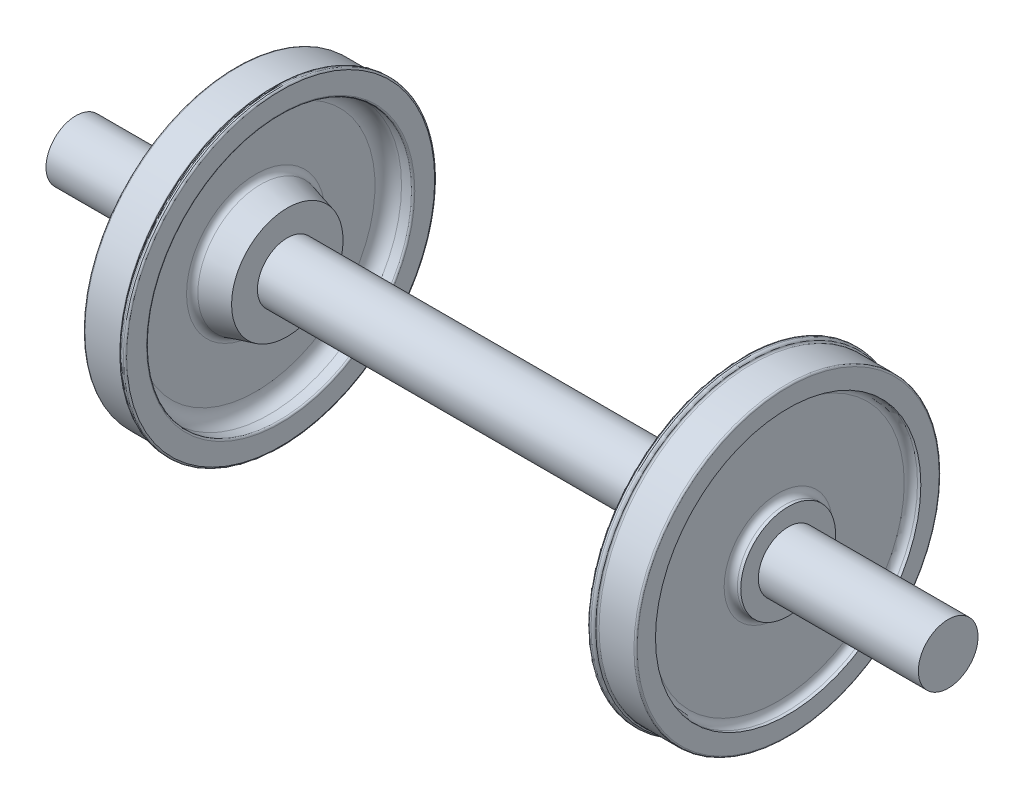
ISO-10303-21;
HEADER;
FILE_DESCRIPTION(('STEP AP214'),'2;1');
FILE_NAME('part.step','',(''),(''),'','','');
FILE_SCHEMA(('AUTOMOTIVE_DESIGN { 1 0 10303 214 1 1 1 1 }'));
ENDSEC;
DATA;
#1=APPLICATION_CONTEXT('core data for automotive mechanical design processes');
#2=APPLICATION_PROTOCOL_DEFINITION('international standard','automotive_design',2000,#1);
#3=PRODUCT_CONTEXT('',#1,'mechanical');
#4=PRODUCT('Part','Part','',(#3));
#5=PRODUCT_RELATED_PRODUCT_CATEGORY('part','',(#4));
#6=PRODUCT_DEFINITION_FORMATION('','',#4);
#7=PRODUCT_DEFINITION_CONTEXT('part definition',#1,'design');
#8=PRODUCT_DEFINITION('design','',#6,#7);
#9=PRODUCT_DEFINITION_SHAPE('','',#8);
#10=(LENGTH_UNIT() NAMED_UNIT(*) SI_UNIT(.MILLI.,.METRE.));
#11=(NAMED_UNIT(*) PLANE_ANGLE_UNIT() SI_UNIT($,.RADIAN.));
#12=(NAMED_UNIT(*) SI_UNIT($,.STERADIAN.) SOLID_ANGLE_UNIT());
#13=UNCERTAINTY_MEASURE_WITH_UNIT(LENGTH_MEASURE(1.E-05),#10,'distance_accuracy_value','');
#14=(GEOMETRIC_REPRESENTATION_CONTEXT(3) GLOBAL_UNCERTAINTY_ASSIGNED_CONTEXT((#13)) GLOBAL_UNIT_ASSIGNED_CONTEXT((#10,
#11,#12)) REPRESENTATION_CONTEXT('',''));
#15=CARTESIAN_POINT('',(0.,0.,0.));
#16=DIRECTION('',(0.,0.,1.));
#17=DIRECTION('',(1.,0.,0.));
#18=AXIS2_PLACEMENT_3D('',#15,#16,#17);
#19=CARTESIAN_POINT('',(822.5,0.,0.));
#20=DIRECTION('',(-1.,0.,0.));
#21=DIRECTION('',(0.,0.,1.));
#22=AXIS2_PLACEMENT_3D('',#19,#20,#21);
#23=TOROIDAL_SURFACE('',#22,380.,20.);
#24=CARTESIAN_POINT('',(822.5,0.,0.));
#25=DIRECTION('',(-1.,0.,0.));
#26=DIRECTION('',(0.,0.,1.));
#27=AXIS2_PLACEMENT_3D('',#24,#25,#26);
#28=CIRCLE('',#27,400.);
#29=CARTESIAN_POINT('',(822.5,0.,400.));
#30=VERTEX_POINT('',#29);
#31=EDGE_CURVE('E181',#30,#30,#28,.T.);
#32=ORIENTED_EDGE('',*,*,#31,.F.);
#33=EDGE_LOOP('',(#32));
#34=FACE_BOUND('',#33,.T.);
#35=CARTESIAN_POINT('',(802.5,0.,0.));
#36=DIRECTION('',(-1.,0.,0.));
#37=DIRECTION('',(0.,0.,1.));
#38=AXIS2_PLACEMENT_3D('',#35,#36,#37);
#39=CIRCLE('',#38,380.);
#40=CARTESIAN_POINT('',(802.5,0.,380.));
#41=VERTEX_POINT('',#40);
#42=EDGE_CURVE('E10',#41,#41,#39,.T.);
#43=ORIENTED_EDGE('',*,*,#42,.T.);
#44=EDGE_LOOP('',(#43));
#45=FACE_BOUND('',#44,.T.);
#46=ADVANCED_FACE('F33',(#34,#45),#23,.F.);
#47=CARTESIAN_POINT('',(802.5,380.,0.));
#48=DIRECTION('',(-1.,0.,0.));
#49=DIRECTION('',(0.,0.,1.));
#50=AXIS2_PLACEMENT_3D('',#47,#48,#49);
#51=PLANE('',#50);
#52=ORIENTED_EDGE('',*,*,#42,.F.);
#53=EDGE_LOOP('',(#52));
#54=FACE_BOUND('',#53,.T.);
#55=CARTESIAN_POINT('',(802.500000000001,0.,0.));
#56=DIRECTION('',(-1.,0.,0.));
#57=DIRECTION('',(0.,0.,1.));
#58=AXIS2_PLACEMENT_3D('',#55,#56,#57);
#59=CIRCLE('',#58,163.);
#60=CARTESIAN_POINT('',(802.500000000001,0.,163.));
#61=VERTEX_POINT('',#60);
#62=EDGE_CURVE('E39',#61,#61,#59,.T.);
#63=ORIENTED_EDGE('',*,*,#62,.T.);
#64=EDGE_LOOP('',(#63));
#65=FACE_BOUND('',#64,.T.);
#66=ADVANCED_FACE('F188',(#54,#65),#51,.F.);
#67=CARTESIAN_POINT('',(822.500000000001,0.,0.));
#68=DIRECTION('',(-1.,0.,0.));
#69=DIRECTION('',(0.,0.,1.));
#70=AXIS2_PLACEMENT_3D('',#67,#68,#69);
#71=TOROIDAL_SURFACE('',#70,163.,20.0000000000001);
#72=ORIENTED_EDGE('',*,*,#62,.F.);
#73=EDGE_LOOP('',(#72));
#74=FACE_BOUND('',#73,.T.);
#75=CARTESIAN_POINT('',(822.500000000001,0.,0.));
#76=DIRECTION('',(-1.,0.,0.));
#77=DIRECTION('',(0.,0.,1.));
#78=AXIS2_PLACEMENT_3D('',#75,#76,#77);
#79=CIRCLE('',#78,143.);
#80=CARTESIAN_POINT('',(822.500000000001,0.,143.));
#81=VERTEX_POINT('',#80);
#82=EDGE_CURVE('E43',#81,#81,#79,.T.);
#83=ORIENTED_EDGE('',*,*,#82,.T.);
#84=EDGE_LOOP('',(#83));
#85=FACE_BOUND('',#84,.T.);
#86=ADVANCED_FACE('F192',(#74,#85),#71,.F.);
#87=CARTESIAN_POINT('',(0.,0.,0.));
#88=DIRECTION('',(-1.,0.,0.));
#89=DIRECTION('',(0.,0.,1.));
#90=AXIS2_PLACEMENT_3D('',#87,#88,#89);
#91=CYLINDRICAL_SURFACE('',#90,143.);
#92=ORIENTED_EDGE('',*,*,#82,.F.);
#93=EDGE_LOOP('',(#92));
#94=FACE_BOUND('',#93,.T.);
#95=CARTESIAN_POINT('',(832.500000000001,0.,0.));
#96=DIRECTION('',(-1.,0.,0.));
#97=DIRECTION('',(0.,0.,1.));
#98=AXIS2_PLACEMENT_3D('',#95,#96,#97);
#99=CIRCLE('',#98,143.);
#100=CARTESIAN_POINT('',(832.500000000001,0.,143.));
#101=VERTEX_POINT('',#100);
#102=EDGE_CURVE('E47',#101,#101,#99,.T.);
#103=ORIENTED_EDGE('',*,*,#102,.T.);
#104=EDGE_LOOP('',(#103));
#105=FACE_BOUND('',#104,.T.);
#106=ADVANCED_FACE('F197',(#94,#105),#91,.T.);
#107=CARTESIAN_POINT('',(832.5,143.,0.));
#108=DIRECTION('',(-1.,0.,0.));
#109=DIRECTION('',(0.,0.,1.));
#110=AXIS2_PLACEMENT_3D('',#107,#108,#109);
#111=PLANE('',#110);
#112=ORIENTED_EDGE('',*,*,#102,.F.);
#113=EDGE_LOOP('',(#112));
#114=FACE_BOUND('',#113,.T.);
#115=CARTESIAN_POINT('',(832.5,0.,0.));
#116=DIRECTION('',(-1.,0.,0.));
#117=DIRECTION('',(0.,0.,1.));
#118=AXIS2_PLACEMENT_3D('',#115,#116,#117);
#119=CIRCLE('',#118,90.);
#120=CARTESIAN_POINT('',(832.5,0.,90.));
#121=VERTEX_POINT('',#120);
#122=EDGE_CURVE('E52',#121,#121,#119,.T.);
#123=ORIENTED_EDGE('',*,*,#122,.T.);
#124=EDGE_LOOP('',(#123));
#125=FACE_BOUND('',#124,.T.);
#126=ADVANCED_FACE('F203',(#114,#125),#111,.F.);
#127=CARTESIAN_POINT('',(0.,0.,0.));
#128=DIRECTION('',(-1.,0.,0.));
#129=DIRECTION('',(0.,0.,1.));
#130=AXIS2_PLACEMENT_3D('',#127,#128,#129);
#131=CYLINDRICAL_SURFACE('',#130,90.);
#132=ORIENTED_EDGE('',*,*,#122,.F.);
#133=EDGE_LOOP('',(#132));
#134=FACE_BOUND('',#133,.T.);
#135=CARTESIAN_POINT('',(1315.,0.,0.));
#136=DIRECTION('',(-1.,0.,0.));
#137=DIRECTION('',(0.,0.,1.));
#138=AXIS2_PLACEMENT_3D('',#135,#136,#137);
#139=CIRCLE('',#138,90.);
#140=CARTESIAN_POINT('',(1315.,0.,90.));
#141=VERTEX_POINT('',#140);
#142=EDGE_CURVE('E55',#141,#141,#139,.T.);
#143=ORIENTED_EDGE('',*,*,#142,.T.);
#144=EDGE_LOOP('',(#143));
#145=FACE_BOUND('',#144,.T.);
#146=ADVANCED_FACE('F207',(#134,#145),#131,.T.);
#147=CARTESIAN_POINT('',(1315.,90.,0.));
#148=DIRECTION('',(-1.,0.,0.));
#149=DIRECTION('',(0.,0.,1.));
#150=AXIS2_PLACEMENT_3D('',#147,#148,#149);
#151=PLANE('',#150);
#152=ORIENTED_EDGE('',*,*,#142,.F.);
#153=EDGE_LOOP('',(#152));
#154=FACE_BOUND('',#153,.T.);
#155=ADVANCED_FACE('F211',(#154),#151,.F.);
#156=CARTESIAN_POINT('',(-1315.,89.9999999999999,0.));
#157=DIRECTION('',(1.,0.,0.));
#158=DIRECTION('',(0.,0.,-1.));
#159=AXIS2_PLACEMENT_3D('',#156,#157,#158);
#160=PLANE('',#159);
#161=CARTESIAN_POINT('',(-1315.,0.,0.));
#162=DIRECTION('',(-1.,0.,0.));
#163=DIRECTION('',(0.,0.,1.));
#164=AXIS2_PLACEMENT_3D('',#161,#162,#163);
#165=CIRCLE('',#164,89.9999999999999);
#166=CARTESIAN_POINT('',(-1315.,0.,89.9999999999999));
#167=VERTEX_POINT('',#166);
#168=EDGE_CURVE('E58',#167,#167,#165,.T.);
#169=ORIENTED_EDGE('',*,*,#168,.T.);
#170=EDGE_LOOP('',(#169));
#171=FACE_BOUND('',#170,.T.);
#172=ADVANCED_FACE('F215',(#171),#160,.F.);
#173=CARTESIAN_POINT('',(0.,0.,0.));
#174=DIRECTION('',(-1.,0.,0.));
#175=DIRECTION('',(0.,0.,1.));
#176=AXIS2_PLACEMENT_3D('',#173,#174,#175);
#177=CYLINDRICAL_SURFACE('',#176,89.9999999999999);
#178=ORIENTED_EDGE('',*,*,#168,.F.);
#179=EDGE_LOOP('',(#178));
#180=FACE_BOUND('',#179,.T.);
#181=CARTESIAN_POINT('',(-832.5,0.,0.));
#182=DIRECTION('',(-1.,0.,0.));
#183=DIRECTION('',(0.,0.,1.));
#184=AXIS2_PLACEMENT_3D('',#181,#182,#183);
#185=CIRCLE('',#184,89.9999999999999);
#186=CARTESIAN_POINT('',(-832.5,0.,89.9999999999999));
#187=VERTEX_POINT('',#186);
#188=EDGE_CURVE('E61',#187,#187,#185,.T.);
#189=ORIENTED_EDGE('',*,*,#188,.T.);
#190=EDGE_LOOP('',(#189));
#191=FACE_BOUND('',#190,.T.);
#192=ADVANCED_FACE('F219',(#180,#191),#177,.T.);
#193=CARTESIAN_POINT('',(-832.5,143.,0.));
#194=DIRECTION('',(1.,0.,0.));
#195=DIRECTION('',(0.,0.,-1.));
#196=AXIS2_PLACEMENT_3D('',#193,#194,#195);
#197=PLANE('',#196);
#198=ORIENTED_EDGE('',*,*,#188,.F.);
#199=EDGE_LOOP('',(#198));
#200=FACE_BOUND('',#199,.T.);
#201=CARTESIAN_POINT('',(-832.500000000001,0.,0.));
#202=DIRECTION('',(-1.,0.,0.));
#203=DIRECTION('',(0.,0.,1.));
#204=AXIS2_PLACEMENT_3D('',#201,#202,#203);
#205=CIRCLE('',#204,143.);
#206=CARTESIAN_POINT('',(-832.500000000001,0.,143.));
#207=VERTEX_POINT('',#206);
#208=EDGE_CURVE('E64',#207,#207,#205,.T.);
#209=ORIENTED_EDGE('',*,*,#208,.T.);
#210=EDGE_LOOP('',(#209));
#211=FACE_BOUND('',#210,.T.);
#212=ADVANCED_FACE('F223',(#200,#211),#197,.F.);
#213=CARTESIAN_POINT('',(0.,0.,0.));
#214=DIRECTION('',(-1.,0.,0.));
#215=DIRECTION('',(0.,0.,1.));
#216=AXIS2_PLACEMENT_3D('',#213,#214,#215);
#217=CYLINDRICAL_SURFACE('',#216,143.);
#218=ORIENTED_EDGE('',*,*,#208,.F.);
#219=EDGE_LOOP('',(#218));
#220=FACE_BOUND('',#219,.T.);
#221=CARTESIAN_POINT('',(-822.500000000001,0.,0.));
#222=DIRECTION('',(-1.,0.,0.));
#223=DIRECTION('',(0.,0.,1.));
#224=AXIS2_PLACEMENT_3D('',#221,#222,#223);
#225=CIRCLE('',#224,143.);
#226=CARTESIAN_POINT('',(-822.500000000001,0.,143.));
#227=VERTEX_POINT('',#226);
#228=EDGE_CURVE('E67',#227,#227,#225,.T.);
#229=ORIENTED_EDGE('',*,*,#228,.T.);
#230=EDGE_LOOP('',(#229));
#231=FACE_BOUND('',#230,.T.);
#232=ADVANCED_FACE('F227',(#220,#231),#217,.T.);
#233=CARTESIAN_POINT('',(-822.500000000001,0.,0.));
#234=DIRECTION('',(-1.,0.,0.));
#235=DIRECTION('',(0.,0.,1.));
#236=AXIS2_PLACEMENT_3D('',#233,#234,#235);
#237=TOROIDAL_SURFACE('',#236,163.,20.0000000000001);
#238=ORIENTED_EDGE('',*,*,#228,.F.);
#239=EDGE_LOOP('',(#238));
#240=FACE_BOUND('',#239,.T.);
#241=CARTESIAN_POINT('',(-802.500000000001,0.,0.));
#242=DIRECTION('',(-1.,0.,0.));
#243=DIRECTION('',(0.,0.,1.));
#244=AXIS2_PLACEMENT_3D('',#241,#242,#243);
#245=CIRCLE('',#244,163.);
#246=CARTESIAN_POINT('',(-802.500000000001,0.,163.));
#247=VERTEX_POINT('',#246);
#248=EDGE_CURVE('E70',#247,#247,#245,.T.);
#249=ORIENTED_EDGE('',*,*,#248,.T.);
#250=EDGE_LOOP('',(#249));
#251=FACE_BOUND('',#250,.T.);
#252=ADVANCED_FACE('F231',(#240,#251),#237,.F.);
#253=CARTESIAN_POINT('',(-802.5,380.,0.));
#254=DIRECTION('',(1.,0.,0.));
#255=DIRECTION('',(0.,0.,-1.));
#256=AXIS2_PLACEMENT_3D('',#253,#254,#255);
#257=PLANE('',#256);
#258=ORIENTED_EDGE('',*,*,#248,.F.);
#259=EDGE_LOOP('',(#258));
#260=FACE_BOUND('',#259,.T.);
#261=CARTESIAN_POINT('',(-802.5,0.,0.));
#262=DIRECTION('',(-1.,0.,0.));
#263=DIRECTION('',(0.,0.,1.));
#264=AXIS2_PLACEMENT_3D('',#261,#262,#263);
#265=CIRCLE('',#264,380.);
#266=CARTESIAN_POINT('',(-802.5,0.,380.));
#267=VERTEX_POINT('',#266);
#268=EDGE_CURVE('E73',#267,#267,#265,.T.);
#269=ORIENTED_EDGE('',*,*,#268,.T.);
#270=EDGE_LOOP('',(#269));
#271=FACE_BOUND('',#270,.T.);
#272=ADVANCED_FACE('F235',(#260,#271),#257,.F.);
#273=CARTESIAN_POINT('',(-822.5,0.,0.));
#274=DIRECTION('',(-1.,0.,0.));
#275=DIRECTION('',(0.,0.,1.));
#276=AXIS2_PLACEMENT_3D('',#273,#274,#275);
#277=TOROIDAL_SURFACE('',#276,380.,20.);
#278=ORIENTED_EDGE('',*,*,#268,.F.);
#279=EDGE_LOOP('',(#278));
#280=FACE_BOUND('',#279,.T.);
#281=CARTESIAN_POINT('',(-822.5,0.,0.));
#282=DIRECTION('',(-1.,0.,0.));
#283=DIRECTION('',(0.,0.,1.));
#284=AXIS2_PLACEMENT_3D('',#281,#282,#283);
#285=CIRCLE('',#284,400.);
#286=CARTESIAN_POINT('',(-822.5,0.,400.));
#287=VERTEX_POINT('',#286);
#288=EDGE_CURVE('E76',#287,#287,#285,.T.);
#289=ORIENTED_EDGE('',*,*,#288,.T.);
#290=EDGE_LOOP('',(#289));
#291=FACE_BOUND('',#290,.T.);
#292=ADVANCED_FACE('F239',(#280,#291),#277,.F.);
#293=CARTESIAN_POINT('',(0.,0.,0.));
#294=DIRECTION('',(-1.,0.,0.));
#295=DIRECTION('',(0.,0.,1.));
#296=AXIS2_PLACEMENT_3D('',#293,#294,#295);
#297=CYLINDRICAL_SURFACE('',#296,400.000000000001);
#298=ORIENTED_EDGE('',*,*,#288,.F.);
#299=EDGE_LOOP('',(#298));
#300=FACE_BOUND('',#299,.T.);
#301=CARTESIAN_POINT('',(-832.5,0.,0.));
#302=DIRECTION('',(-1.,0.,0.));
#303=DIRECTION('',(0.,0.,1.));
#304=AXIS2_PLACEMENT_3D('',#301,#302,#303);
#305=CIRCLE('',#304,400.000000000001);
#306=CARTESIAN_POINT('',(-832.5,0.,400.000000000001));
#307=VERTEX_POINT('',#306);
#308=EDGE_CURVE('E79',#307,#307,#305,.T.);
#309=ORIENTED_EDGE('',*,*,#308,.T.);
#310=EDGE_LOOP('',(#309));
#311=FACE_BOUND('',#310,.T.);
#312=ADVANCED_FACE('F243',(#300,#311),#297,.F.);
#313=CARTESIAN_POINT('',(-832.5,455.000000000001,0.));
#314=DIRECTION('',(1.,0.,0.));
#315=DIRECTION('',(0.,0.,-1.));
#316=AXIS2_PLACEMENT_3D('',#313,#314,#315);
#317=PLANE('',#316);
#318=ORIENTED_EDGE('',*,*,#308,.F.);
#319=EDGE_LOOP('',(#318));
#320=FACE_BOUND('',#319,.T.);
#321=CARTESIAN_POINT('',(-832.5,0.,0.));
#322=DIRECTION('',(-1.,0.,0.));
#323=DIRECTION('',(0.,0.,1.));
#324=AXIS2_PLACEMENT_3D('',#321,#322,#323);
#325=CIRCLE('',#324,455.000000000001);
#326=CARTESIAN_POINT('',(-832.5,0.,455.000000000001));
#327=VERTEX_POINT('',#326);
#328=EDGE_CURVE('E82',#327,#327,#325,.T.);
#329=ORIENTED_EDGE('',*,*,#328,.T.);
#330=EDGE_LOOP('',(#329));
#331=FACE_BOUND('',#330,.T.);
#332=ADVANCED_FACE('F247',(#320,#331),#317,.F.);
#333=CARTESIAN_POINT('',(-827.5,0.,0.));
#334=DIRECTION('',(-1.,0.,0.));
#335=DIRECTION('',(0.,0.,1.));
#336=AXIS2_PLACEMENT_3D('',#333,#334,#335);
#337=TOROIDAL_SURFACE('',#336,455.,5.00000000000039);
#338=ORIENTED_EDGE('',*,*,#328,.F.);
#339=EDGE_LOOP('',(#338));
#340=FACE_BOUND('',#339,.T.);
#341=CARTESIAN_POINT('',(-827.5,0.,0.));
#342=DIRECTION('',(-1.,0.,0.));
#343=DIRECTION('',(0.,0.,1.));
#344=AXIS2_PLACEMENT_3D('',#341,#342,#343);
#345=CIRCLE('',#344,460.000000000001);
#346=CARTESIAN_POINT('',(-827.5,0.,460.000000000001));
#347=VERTEX_POINT('',#346);
#348=EDGE_CURVE('E85',#347,#347,#345,.T.);
#349=ORIENTED_EDGE('',*,*,#348,.T.);
#350=EDGE_LOOP('',(#349));
#351=FACE_BOUND('',#350,.T.);
#352=ADVANCED_FACE('F251',(#340,#351),#337,.T.);
#353=CARTESIAN_POINT('',(0.,0.,0.));
#354=DIRECTION('',(-1.,0.,0.));
#355=DIRECTION('',(0.,0.,1.));
#356=AXIS2_PLACEMENT_3D('',#353,#354,#355);
#357=CYLINDRICAL_SURFACE('',#356,460.);
#358=ORIENTED_EDGE('',*,*,#348,.F.);
#359=EDGE_LOOP('',(#358));
#360=FACE_BOUND('',#359,.T.);
#361=CARTESIAN_POINT('',(-722.5,0.,0.));
#362=DIRECTION('',(-1.,0.,0.));
#363=DIRECTION('',(0.,0.,1.));
#364=AXIS2_PLACEMENT_3D('',#361,#362,#363);
#365=CIRCLE('',#364,460.);
#366=CARTESIAN_POINT('',(-722.5,0.,460.));
#367=VERTEX_POINT('',#366);
#368=EDGE_CURVE('E88',#367,#367,#365,.T.);
#369=ORIENTED_EDGE('',*,*,#368,.T.);
#370=EDGE_LOOP('',(#369));
#371=FACE_BOUND('',#370,.T.);
#372=ADVANCED_FACE('F255',(#360,#371),#357,.T.);
#373=CARTESIAN_POINT('',(-722.5,0.,0.));
#374=DIRECTION('',(-1.,0.,0.));
#375=DIRECTION('',(0.,0.,1.));
#376=AXIS2_PLACEMENT_3D('',#373,#374,#375);
#377=TOROIDAL_SURFACE('',#376,465.,5.00000000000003);
#378=ORIENTED_EDGE('',*,*,#368,.F.);
#379=EDGE_LOOP('',(#378));
#380=FACE_BOUND('',#379,.T.);
#381=CARTESIAN_POINT('',(-717.5,0.,0.));
#382=DIRECTION('',(-1.,0.,0.));
#383=DIRECTION('',(0.,0.,1.));
#384=AXIS2_PLACEMENT_3D('',#381,#382,#383);
#385=CIRCLE('',#384,465.);
#386=CARTESIAN_POINT('',(-717.5,0.,465.));
#387=VERTEX_POINT('',#386);
#388=EDGE_CURVE('E91',#387,#387,#385,.T.);
#389=ORIENTED_EDGE('',*,*,#388,.T.);
#390=EDGE_LOOP('',(#389));
#391=FACE_BOUND('',#390,.T.);
#392=ADVANCED_FACE('F259',(#380,#391),#377,.F.);
#393=CARTESIAN_POINT('',(-717.5,459.37867092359,0.));
#394=DIRECTION('',(-1.,0.,0.));
#395=DIRECTION('',(0.,0.,1.));
#396=AXIS2_PLACEMENT_3D('',#393,#394,#395);
#397=PLANE('',#396);
#398=ORIENTED_EDGE('',*,*,#388,.F.);
#399=EDGE_LOOP('',(#398));
#400=FACE_BOUND('',#399,.T.);
#401=CARTESIAN_POINT('',(-717.5,0.,0.));
#402=DIRECTION('',(-1.,0.,0.));
#403=DIRECTION('',(0.,0.,1.));
#404=AXIS2_PLACEMENT_3D('',#401,#402,#403);
#405=CIRCLE('',#404,459.37867092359);
#406=CARTESIAN_POINT('',(-717.5,0.,459.37867092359));
#407=VERTEX_POINT('',#406);
#408=EDGE_CURVE('E94',#407,#407,#405,.T.);
#409=ORIENTED_EDGE('',*,*,#408,.T.);
#410=EDGE_LOOP('',(#409));
#411=FACE_BOUND('',#410,.T.);
#412=ADVANCED_FACE('F263',(#400,#411),#397,.F.);
#413=CARTESIAN_POINT('',(-707.5,0.,0.));
#414=DIRECTION('',(-1.,0.,0.));
#415=DIRECTION('',(0.,0.,1.));
#416=AXIS2_PLACEMENT_3D('',#413,#414,#415);
#417=TOROIDAL_SURFACE('',#416,459.37867092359,10.);
#418=ORIENTED_EDGE('',*,*,#408,.F.);
#419=EDGE_LOOP('',(#418));
#420=FACE_BOUND('',#419,.T.);
#421=CARTESIAN_POINT('',(-707.5,0.,0.));
#422=DIRECTION('',(-1.,0.,0.));
#423=DIRECTION('',(0.,0.,1.));
#424=AXIS2_PLACEMENT_3D('',#421,#422,#423);
#425=CIRCLE('',#424,469.37867092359);
#426=CARTESIAN_POINT('',(-707.5,0.,469.37867092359));
#427=VERTEX_POINT('',#426);
#428=EDGE_CURVE('E97',#427,#427,#425,.T.);
#429=ORIENTED_EDGE('',*,*,#428,.T.);
#430=EDGE_LOOP('',(#429));
#431=FACE_BOUND('',#430,.T.);
#432=ADVANCED_FACE('F267',(#420,#431),#417,.T.);
#433=CARTESIAN_POINT('',(0.,0.,0.));
#434=DIRECTION('',(-1.,0.,0.));
#435=DIRECTION('',(0.,0.,1.));
#436=AXIS2_PLACEMENT_3D('',#433,#434,#435);
#437=CYLINDRICAL_SURFACE('',#436,469.37867092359);
#438=ORIENTED_EDGE('',*,*,#428,.F.);
#439=EDGE_LOOP('',(#438));
#440=FACE_BOUND('',#439,.T.);
#441=CARTESIAN_POINT('',(-702.5,0.,0.));
#442=DIRECTION('',(-1.,0.,0.));
#443=DIRECTION('',(0.,0.,1.));
#444=AXIS2_PLACEMENT_3D('',#441,#442,#443);
#445=CIRCLE('',#444,469.37867092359);
#446=CARTESIAN_POINT('',(-702.5,0.,469.37867092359));
#447=VERTEX_POINT('',#446);
#448=EDGE_CURVE('E100',#447,#447,#445,.T.);
#449=ORIENTED_EDGE('',*,*,#448,.T.);
#450=EDGE_LOOP('',(#449));
#451=FACE_BOUND('',#450,.T.);
#452=ADVANCED_FACE('F271',(#440,#451),#437,.T.);
#453=CARTESIAN_POINT('',(-702.5,0.,0.));
#454=DIRECTION('',(-1.,0.,0.));
#455=DIRECTION('',(0.,0.,1.));
#456=AXIS2_PLACEMENT_3D('',#453,#454,#455);
#457=TOROIDAL_SURFACE('',#456,464.37867092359,5.);
#458=ORIENTED_EDGE('',*,*,#448,.F.);
#459=EDGE_LOOP('',(#458));
#460=FACE_BOUND('',#459,.T.);
#461=CARTESIAN_POINT('',(-697.5,0.,0.));
#462=DIRECTION('',(-1.,0.,0.));
#463=DIRECTION('',(0.,0.,1.));
#464=AXIS2_PLACEMENT_3D('',#461,#462,#463);
#465=CIRCLE('',#464,464.37867092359);
#466=CARTESIAN_POINT('',(-697.5,0.,464.37867092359));
#467=VERTEX_POINT('',#466);
#468=EDGE_CURVE('E103',#467,#467,#465,.T.);
#469=ORIENTED_EDGE('',*,*,#468,.T.);
#470=EDGE_LOOP('',(#469));
#471=FACE_BOUND('',#470,.T.);
#472=ADVANCED_FACE('F275',(#460,#471),#457,.T.);
#473=CARTESIAN_POINT('',(-697.5,404.37867092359,0.));
#474=DIRECTION('',(-1.,0.,0.));
#475=DIRECTION('',(0.,0.,1.));
#476=AXIS2_PLACEMENT_3D('',#473,#474,#475);
#477=PLANE('',#476);
#478=ORIENTED_EDGE('',*,*,#468,.F.);
#479=EDGE_LOOP('',(#478));
#480=FACE_BOUND('',#479,.T.);
#481=CARTESIAN_POINT('',(-697.5,0.,0.));
#482=DIRECTION('',(-1.,0.,0.));
#483=DIRECTION('',(0.,0.,1.));
#484=AXIS2_PLACEMENT_3D('',#481,#482,#483);
#485=CIRCLE('',#484,404.37867092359);
#486=CARTESIAN_POINT('',(-697.5,0.,404.37867092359));
#487=VERTEX_POINT('',#486);
#488=EDGE_CURVE('E106',#487,#487,#485,.T.);
#489=ORIENTED_EDGE('',*,*,#488,.T.);
#490=EDGE_LOOP('',(#489));
#491=FACE_BOUND('',#490,.T.);
#492=ADVANCED_FACE('F279',(#480,#491),#477,.F.);
#493=CARTESIAN_POINT('',(-702.5,0.,0.));
#494=DIRECTION('',(-1.,0.,0.));
#495=DIRECTION('',(0.,0.,1.));
#496=AXIS2_PLACEMENT_3D('',#493,#494,#495);
#497=TOROIDAL_SURFACE('',#496,404.37867092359,4.99999999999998);
#498=ORIENTED_EDGE('',*,*,#488,.F.);
#499=EDGE_LOOP('',(#498));
#500=FACE_BOUND('',#499,.T.);
#501=CARTESIAN_POINT('',(-702.5,0.,0.));
#502=DIRECTION('',(-1.,0.,0.));
#503=DIRECTION('',(0.,0.,1.));
#504=AXIS2_PLACEMENT_3D('',#501,#502,#503);
#505=CIRCLE('',#504,399.37867092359);
#506=CARTESIAN_POINT('',(-702.5,0.,399.37867092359));
#507=VERTEX_POINT('',#506);
#508=EDGE_CURVE('E109',#507,#507,#505,.T.);
#509=ORIENTED_EDGE('',*,*,#508,.T.);
#510=EDGE_LOOP('',(#509));
#511=FACE_BOUND('',#510,.T.);
#512=ADVANCED_FACE('F283',(#500,#511),#497,.T.);
#513=CARTESIAN_POINT('',(0.,0.,0.));
#514=DIRECTION('',(-1.,0.,0.));
#515=DIRECTION('',(0.,0.,1.));
#516=AXIS2_PLACEMENT_3D('',#513,#514,#515);
#517=CYLINDRICAL_SURFACE('',#516,399.37867092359);
#518=ORIENTED_EDGE('',*,*,#508,.F.);
#519=EDGE_LOOP('',(#518));
#520=FACE_BOUND('',#519,.T.);
#521=CARTESIAN_POINT('',(-732.5,0.,0.));
#522=DIRECTION('',(-1.,0.,0.));
#523=DIRECTION('',(0.,0.,1.));
#524=AXIS2_PLACEMENT_3D('',#521,#522,#523);
#525=CIRCLE('',#524,399.37867092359);
#526=CARTESIAN_POINT('',(-732.5,0.,399.37867092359));
#527=VERTEX_POINT('',#526);
#528=EDGE_CURVE('E112',#527,#527,#525,.T.);
#529=ORIENTED_EDGE('',*,*,#528,.T.);
#530=EDGE_LOOP('',(#529));
#531=FACE_BOUND('',#530,.T.);
#532=ADVANCED_FACE('F287',(#520,#531),#517,.F.);
#533=CARTESIAN_POINT('',(-732.5,0.,0.));
#534=DIRECTION('',(-1.,0.,0.));
#535=DIRECTION('',(0.,0.,1.));
#536=AXIS2_PLACEMENT_3D('',#533,#534,#535);
#537=TOROIDAL_SURFACE('',#536,359.37867092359,40.);
#538=ORIENTED_EDGE('',*,*,#528,.F.);
#539=EDGE_LOOP('',(#538));
#540=FACE_BOUND('',#539,.T.);
#541=CARTESIAN_POINT('',(-772.5,0.,0.));
#542=DIRECTION('',(-1.,0.,0.));
#543=DIRECTION('',(0.,0.,1.));
#544=AXIS2_PLACEMENT_3D('',#541,#542,#543);
#545=CIRCLE('',#544,359.37867092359);
#546=CARTESIAN_POINT('',(-772.5,0.,359.37867092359));
#547=VERTEX_POINT('',#546);
#548=EDGE_CURVE('E115',#547,#547,#545,.T.);
#549=ORIENTED_EDGE('',*,*,#548,.T.);
#550=EDGE_LOOP('',(#549));
#551=FACE_BOUND('',#550,.T.);
#552=ADVANCED_FACE('F291',(#540,#551),#537,.F.);
#553=CARTESIAN_POINT('',(-772.5,208.801713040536,0.));
#554=DIRECTION('',(-1.,0.,0.));
#555=DIRECTION('',(0.,0.,1.));
#556=AXIS2_PLACEMENT_3D('',#553,#554,#555);
#557=PLANE('',#556);
#558=ORIENTED_EDGE('',*,*,#548,.F.);
#559=EDGE_LOOP('',(#558));
#560=FACE_BOUND('',#559,.T.);
#561=CARTESIAN_POINT('',(-772.5,0.,0.));
#562=DIRECTION('',(-1.,0.,0.));
#563=DIRECTION('',(0.,0.,1.));
#564=AXIS2_PLACEMENT_3D('',#561,#562,#563);
#565=CIRCLE('',#564,208.801713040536);
#566=CARTESIAN_POINT('',(-772.5,0.,208.801713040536));
#567=VERTEX_POINT('',#566);
#568=EDGE_CURVE('E118',#567,#567,#565,.T.);
#569=ORIENTED_EDGE('',*,*,#568,.T.);
#570=EDGE_LOOP('',(#569));
#571=FACE_BOUND('',#570,.T.);
#572=ADVANCED_FACE('F295',(#560,#571),#557,.F.);
#573=CARTESIAN_POINT('',(-752.5,0.,0.));
#574=DIRECTION('',(-1.,0.,0.));
#575=DIRECTION('',(0.,0.,1.));
#576=AXIS2_PLACEMENT_3D('',#573,#574,#575);
#577=TOROIDAL_SURFACE('',#576,208.801713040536,20.);
#578=ORIENTED_EDGE('',*,*,#568,.F.);
#579=EDGE_LOOP('',(#578));
#580=FACE_BOUND('',#579,.T.);
#581=CARTESIAN_POINT('',(-757.67638090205,0.,0.));
#582=DIRECTION('',(-1.,0.,0.));
#583=DIRECTION('',(0.,0.,1.));
#584=AXIS2_PLACEMENT_3D('',#581,#582,#583);
#585=CIRCLE('',#584,189.483196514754);
#586=CARTESIAN_POINT('',(-757.67638090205,0.,189.483196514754));
#587=VERTEX_POINT('',#586);
#588=EDGE_CURVE('E121',#587,#587,#585,.T.);
#589=ORIENTED_EDGE('',*,*,#588,.T.);
#590=EDGE_LOOP('',(#589));
#591=FACE_BOUND('',#590,.T.);
#592=ADVANCED_FACE('F299',(#580,#591),#577,.F.);
#593=CARTESIAN_POINT('',(-677.5,0.,0.));
#594=DIRECTION('',(-1.,0.,0.));
#595=DIRECTION('',(0.,0.,1.));
#596=AXIS2_PLACEMENT_3D('',#593,#594,#595);
#597=CONICAL_SURFACE('',#596,168.,0.261799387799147);
#598=ORIENTED_EDGE('',*,*,#588,.F.);
#599=EDGE_LOOP('',(#598));
#600=FACE_BOUND('',#599,.T.);
#601=CARTESIAN_POINT('',(-677.5,0.,0.));
#602=DIRECTION('',(-1.,0.,0.));
#603=DIRECTION('',(0.,0.,1.));
#604=AXIS2_PLACEMENT_3D('',#601,#602,#603);
#605=CIRCLE('',#604,168.);
#606=CARTESIAN_POINT('',(-677.5,0.,168.));
#607=VERTEX_POINT('',#606);
#608=EDGE_CURVE('E124',#607,#607,#605,.T.);
#609=ORIENTED_EDGE('',*,*,#608,.T.);
#610=EDGE_LOOP('',(#609));
#611=FACE_BOUND('',#610,.T.);
#612=ADVANCED_FACE('F303',(#600,#611),#597,.T.);
#613=CARTESIAN_POINT('',(-677.5,89.9999999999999,0.));
#614=DIRECTION('',(-1.,0.,0.));
#615=DIRECTION('',(0.,0.,1.));
#616=AXIS2_PLACEMENT_3D('',#613,#614,#615);
#617=PLANE('',#616);
#618=ORIENTED_EDGE('',*,*,#608,.F.);
#619=EDGE_LOOP('',(#618));
#620=FACE_BOUND('',#619,.T.);
#621=CARTESIAN_POINT('',(-677.5,0.,0.));
#622=DIRECTION('',(-1.,0.,0.));
#623=DIRECTION('',(0.,0.,1.));
#624=AXIS2_PLACEMENT_3D('',#621,#622,#623);
#625=CIRCLE('',#624,89.9999999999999);
#626=CARTESIAN_POINT('',(-677.5,0.,89.9999999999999));
#627=VERTEX_POINT('',#626);
#628=EDGE_CURVE('E127',#627,#627,#625,.T.);
#629=ORIENTED_EDGE('',*,*,#628,.T.);
#630=EDGE_LOOP('',(#629));
#631=FACE_BOUND('',#630,.T.);
#632=ADVANCED_FACE('F307',(#620,#631),#617,.F.);
#633=CARTESIAN_POINT('',(0.,0.,0.));
#634=DIRECTION('',(-1.,0.,0.));
#635=DIRECTION('',(0.,0.,1.));
#636=AXIS2_PLACEMENT_3D('',#633,#634,#635);
#637=CYLINDRICAL_SURFACE('',#636,90.);
#638=ORIENTED_EDGE('',*,*,#628,.F.);
#639=EDGE_LOOP('',(#638));
#640=FACE_BOUND('',#639,.T.);
#641=CARTESIAN_POINT('',(677.5,0.,0.));
#642=DIRECTION('',(-1.,0.,0.));
#643=DIRECTION('',(0.,0.,1.));
#644=AXIS2_PLACEMENT_3D('',#641,#642,#643);
#645=CIRCLE('',#644,90.);
#646=CARTESIAN_POINT('',(677.5,0.,90.));
#647=VERTEX_POINT('',#646);
#648=EDGE_CURVE('E130',#647,#647,#645,.T.);
#649=ORIENTED_EDGE('',*,*,#648,.T.);
#650=EDGE_LOOP('',(#649));
#651=FACE_BOUND('',#650,.T.);
#652=ADVANCED_FACE('F311',(#640,#651),#637,.T.);
#653=CARTESIAN_POINT('',(677.5,90.,0.));
#654=DIRECTION('',(1.,0.,0.));
#655=DIRECTION('',(0.,0.,-1.));
#656=AXIS2_PLACEMENT_3D('',#653,#654,#655);
#657=PLANE('',#656);
#658=ORIENTED_EDGE('',*,*,#648,.F.);
#659=EDGE_LOOP('',(#658));
#660=FACE_BOUND('',#659,.T.);
#661=CARTESIAN_POINT('',(677.5,0.,0.));
#662=DIRECTION('',(-1.,0.,0.));
#663=DIRECTION('',(0.,0.,1.));
#664=AXIS2_PLACEMENT_3D('',#661,#662,#663);
#665=CIRCLE('',#664,168.);
#666=CARTESIAN_POINT('',(677.5,0.,168.));
#667=VERTEX_POINT('',#666);
#668=EDGE_CURVE('E133',#667,#667,#665,.T.);
#669=ORIENTED_EDGE('',*,*,#668,.T.);
#670=EDGE_LOOP('',(#669));
#671=FACE_BOUND('',#670,.T.);
#672=ADVANCED_FACE('F315',(#660,#671),#657,.F.);
#673=CARTESIAN_POINT('',(757.67638090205,0.,0.));
#674=DIRECTION('',(1.,0.,0.));
#675=DIRECTION('',(0.,0.,-1.));
#676=AXIS2_PLACEMENT_3D('',#673,#674,#675);
#677=CONICAL_SURFACE('',#676,189.483196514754,0.261799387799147);
#678=ORIENTED_EDGE('',*,*,#668,.F.);
#679=EDGE_LOOP('',(#678));
#680=FACE_BOUND('',#679,.T.);
#681=CARTESIAN_POINT('',(757.67638090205,0.,0.));
#682=DIRECTION('',(-1.,0.,0.));
#683=DIRECTION('',(0.,0.,1.));
#684=AXIS2_PLACEMENT_3D('',#681,#682,#683);
#685=CIRCLE('',#684,189.483196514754);
#686=CARTESIAN_POINT('',(757.67638090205,0.,189.483196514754));
#687=VERTEX_POINT('',#686);
#688=EDGE_CURVE('E136',#687,#687,#685,.T.);
#689=ORIENTED_EDGE('',*,*,#688,.T.);
#690=EDGE_LOOP('',(#689));
#691=FACE_BOUND('',#690,.T.);
#692=ADVANCED_FACE('F319',(#680,#691),#677,.T.);
#693=CARTESIAN_POINT('',(752.5,0.,0.));
#694=DIRECTION('',(-1.,0.,0.));
#695=DIRECTION('',(0.,0.,1.));
#696=AXIS2_PLACEMENT_3D('',#693,#694,#695);
#697=TOROIDAL_SURFACE('',#696,208.801713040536,20.);
#698=ORIENTED_EDGE('',*,*,#688,.F.);
#699=EDGE_LOOP('',(#698));
#700=FACE_BOUND('',#699,.T.);
#701=CARTESIAN_POINT('',(772.5,0.,0.));
#702=DIRECTION('',(-1.,0.,0.));
#703=DIRECTION('',(0.,0.,1.));
#704=AXIS2_PLACEMENT_3D('',#701,#702,#703);
#705=CIRCLE('',#704,208.801713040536);
#706=CARTESIAN_POINT('',(772.5,0.,208.801713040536));
#707=VERTEX_POINT('',#706);
#708=EDGE_CURVE('E139',#707,#707,#705,.T.);
#709=ORIENTED_EDGE('',*,*,#708,.T.);
#710=EDGE_LOOP('',(#709));
#711=FACE_BOUND('',#710,.T.);
#712=ADVANCED_FACE('F323',(#700,#711),#697,.F.);
#713=CARTESIAN_POINT('',(772.5,208.801713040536,0.));
#714=DIRECTION('',(1.,0.,0.));
#715=DIRECTION('',(0.,0.,-1.));
#716=AXIS2_PLACEMENT_3D('',#713,#714,#715);
#717=PLANE('',#716);
#718=ORIENTED_EDGE('',*,*,#708,.F.);
#719=EDGE_LOOP('',(#718));
#720=FACE_BOUND('',#719,.T.);
#721=CARTESIAN_POINT('',(772.5,0.,0.));
#722=DIRECTION('',(-1.,0.,0.));
#723=DIRECTION('',(0.,0.,1.));
#724=AXIS2_PLACEMENT_3D('',#721,#722,#723);
#725=CIRCLE('',#724,359.37867092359);
#726=CARTESIAN_POINT('',(772.5,0.,359.37867092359));
#727=VERTEX_POINT('',#726);
#728=EDGE_CURVE('E142',#727,#727,#725,.T.);
#729=ORIENTED_EDGE('',*,*,#728,.T.);
#730=EDGE_LOOP('',(#729));
#731=FACE_BOUND('',#730,.T.);
#732=ADVANCED_FACE('F327',(#720,#731),#717,.F.);
#733=CARTESIAN_POINT('',(732.5,0.,0.));
#734=DIRECTION('',(-1.,0.,0.));
#735=DIRECTION('',(0.,0.,1.));
#736=AXIS2_PLACEMENT_3D('',#733,#734,#735);
#737=TOROIDAL_SURFACE('',#736,359.37867092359,40.);
#738=ORIENTED_EDGE('',*,*,#728,.F.);
#739=EDGE_LOOP('',(#738));
#740=FACE_BOUND('',#739,.T.);
#741=CARTESIAN_POINT('',(732.5,0.,0.));
#742=DIRECTION('',(-1.,0.,0.));
#743=DIRECTION('',(0.,0.,1.));
#744=AXIS2_PLACEMENT_3D('',#741,#742,#743);
#745=CIRCLE('',#744,399.37867092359);
#746=CARTESIAN_POINT('',(732.5,0.,399.37867092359));
#747=VERTEX_POINT('',#746);
#748=EDGE_CURVE('E145',#747,#747,#745,.T.);
#749=ORIENTED_EDGE('',*,*,#748,.T.);
#750=EDGE_LOOP('',(#749));
#751=FACE_BOUND('',#750,.T.);
#752=ADVANCED_FACE('F331',(#740,#751),#737,.F.);
#753=CARTESIAN_POINT('',(0.,0.,0.));
#754=DIRECTION('',(-1.,0.,0.));
#755=DIRECTION('',(0.,0.,1.));
#756=AXIS2_PLACEMENT_3D('',#753,#754,#755);
#757=CYLINDRICAL_SURFACE('',#756,399.37867092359);
#758=ORIENTED_EDGE('',*,*,#748,.F.);
#759=EDGE_LOOP('',(#758));
#760=FACE_BOUND('',#759,.T.);
#761=CARTESIAN_POINT('',(702.5,0.,0.));
#762=DIRECTION('',(-1.,0.,0.));
#763=DIRECTION('',(0.,0.,1.));
#764=AXIS2_PLACEMENT_3D('',#761,#762,#763);
#765=CIRCLE('',#764,399.37867092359);
#766=CARTESIAN_POINT('',(702.5,0.,399.37867092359));
#767=VERTEX_POINT('',#766);
#768=EDGE_CURVE('E148',#767,#767,#765,.T.);
#769=ORIENTED_EDGE('',*,*,#768,.T.);
#770=EDGE_LOOP('',(#769));
#771=FACE_BOUND('',#770,.T.);
#772=ADVANCED_FACE('F335',(#760,#771),#757,.F.);
#773=CARTESIAN_POINT('',(702.5,0.,0.));
#774=DIRECTION('',(-1.,0.,0.));
#775=DIRECTION('',(0.,0.,1.));
#776=AXIS2_PLACEMENT_3D('',#773,#774,#775);
#777=TOROIDAL_SURFACE('',#776,404.37867092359,4.99999999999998);
#778=ORIENTED_EDGE('',*,*,#768,.F.);
#779=EDGE_LOOP('',(#778));
#780=FACE_BOUND('',#779,.T.);
#781=CARTESIAN_POINT('',(697.5,0.,0.));
#782=DIRECTION('',(-1.,0.,0.));
#783=DIRECTION('',(0.,0.,1.));
#784=AXIS2_PLACEMENT_3D('',#781,#782,#783);
#785=CIRCLE('',#784,404.37867092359);
#786=CARTESIAN_POINT('',(697.5,0.,404.37867092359));
#787=VERTEX_POINT('',#786);
#788=EDGE_CURVE('E151',#787,#787,#785,.T.);
#789=ORIENTED_EDGE('',*,*,#788,.T.);
#790=EDGE_LOOP('',(#789));
#791=FACE_BOUND('',#790,.T.);
#792=ADVANCED_FACE('F339',(#780,#791),#777,.T.);
#793=CARTESIAN_POINT('',(697.5,404.37867092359,0.));
#794=DIRECTION('',(1.,0.,0.));
#795=DIRECTION('',(0.,0.,-1.));
#796=AXIS2_PLACEMENT_3D('',#793,#794,#795);
#797=PLANE('',#796);
#798=ORIENTED_EDGE('',*,*,#788,.F.);
#799=EDGE_LOOP('',(#798));
#800=FACE_BOUND('',#799,.T.);
#801=CARTESIAN_POINT('',(697.5,0.,0.));
#802=DIRECTION('',(-1.,0.,0.));
#803=DIRECTION('',(0.,0.,1.));
#804=AXIS2_PLACEMENT_3D('',#801,#802,#803);
#805=CIRCLE('',#804,464.37867092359);
#806=CARTESIAN_POINT('',(697.5,0.,464.37867092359));
#807=VERTEX_POINT('',#806);
#808=EDGE_CURVE('E154',#807,#807,#805,.T.);
#809=ORIENTED_EDGE('',*,*,#808,.T.);
#810=EDGE_LOOP('',(#809));
#811=FACE_BOUND('',#810,.T.);
#812=ADVANCED_FACE('F343',(#800,#811),#797,.F.);
#813=CARTESIAN_POINT('',(702.5,0.,0.));
#814=DIRECTION('',(-1.,0.,0.));
#815=DIRECTION('',(0.,0.,1.));
#816=AXIS2_PLACEMENT_3D('',#813,#814,#815);
#817=TOROIDAL_SURFACE('',#816,464.37867092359,5.);
#818=ORIENTED_EDGE('',*,*,#808,.F.);
#819=EDGE_LOOP('',(#818));
#820=FACE_BOUND('',#819,.T.);
#821=CARTESIAN_POINT('',(702.5,0.,0.));
#822=DIRECTION('',(-1.,0.,0.));
#823=DIRECTION('',(0.,0.,1.));
#824=AXIS2_PLACEMENT_3D('',#821,#822,#823);
#825=CIRCLE('',#824,469.37867092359);
#826=CARTESIAN_POINT('',(702.5,0.,469.37867092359));
#827=VERTEX_POINT('',#826);
#828=EDGE_CURVE('E157',#827,#827,#825,.T.);
#829=ORIENTED_EDGE('',*,*,#828,.T.);
#830=EDGE_LOOP('',(#829));
#831=FACE_BOUND('',#830,.T.);
#832=ADVANCED_FACE('F347',(#820,#831),#817,.T.);
#833=CARTESIAN_POINT('',(0.,0.,0.));
#834=DIRECTION('',(-1.,0.,0.));
#835=DIRECTION('',(0.,0.,1.));
#836=AXIS2_PLACEMENT_3D('',#833,#834,#835);
#837=CYLINDRICAL_SURFACE('',#836,469.37867092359);
#838=ORIENTED_EDGE('',*,*,#828,.F.);
#839=EDGE_LOOP('',(#838));
#840=FACE_BOUND('',#839,.T.);
#841=CARTESIAN_POINT('',(707.5,0.,0.));
#842=DIRECTION('',(-1.,0.,0.));
#843=DIRECTION('',(0.,0.,1.));
#844=AXIS2_PLACEMENT_3D('',#841,#842,#843);
#845=CIRCLE('',#844,469.37867092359);
#846=CARTESIAN_POINT('',(707.5,0.,469.37867092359));
#847=VERTEX_POINT('',#846);
#848=EDGE_CURVE('E160',#847,#847,#845,.T.);
#849=ORIENTED_EDGE('',*,*,#848,.T.);
#850=EDGE_LOOP('',(#849));
#851=FACE_BOUND('',#850,.T.);
#852=ADVANCED_FACE('F351',(#840,#851),#837,.T.);
#853=CARTESIAN_POINT('',(707.5,0.,0.));
#854=DIRECTION('',(-1.,0.,0.));
#855=DIRECTION('',(0.,0.,1.));
#856=AXIS2_PLACEMENT_3D('',#853,#854,#855);
#857=TOROIDAL_SURFACE('',#856,459.37867092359,10.);
#858=ORIENTED_EDGE('',*,*,#848,.F.);
#859=EDGE_LOOP('',(#858));
#860=FACE_BOUND('',#859,.T.);
#861=CARTESIAN_POINT('',(717.5,0.,0.));
#862=DIRECTION('',(-1.,0.,0.));
#863=DIRECTION('',(0.,0.,1.));
#864=AXIS2_PLACEMENT_3D('',#861,#862,#863);
#865=CIRCLE('',#864,459.37867092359);
#866=CARTESIAN_POINT('',(717.5,0.,459.37867092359));
#867=VERTEX_POINT('',#866);
#868=EDGE_CURVE('E163',#867,#867,#865,.T.);
#869=ORIENTED_EDGE('',*,*,#868,.T.);
#870=EDGE_LOOP('',(#869));
#871=FACE_BOUND('',#870,.T.);
#872=ADVANCED_FACE('F355',(#860,#871),#857,.T.);
#873=CARTESIAN_POINT('',(717.5,459.37867092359,0.));
#874=DIRECTION('',(1.,0.,0.));
#875=DIRECTION('',(0.,0.,-1.));
#876=AXIS2_PLACEMENT_3D('',#873,#874,#875);
#877=PLANE('',#876);
#878=ORIENTED_EDGE('',*,*,#868,.F.);
#879=EDGE_LOOP('',(#878));
#880=FACE_BOUND('',#879,.T.);
#881=CARTESIAN_POINT('',(717.5,0.,0.));
#882=DIRECTION('',(-1.,0.,0.));
#883=DIRECTION('',(0.,0.,1.));
#884=AXIS2_PLACEMENT_3D('',#881,#882,#883);
#885=CIRCLE('',#884,465.);
#886=CARTESIAN_POINT('',(717.5,0.,465.));
#887=VERTEX_POINT('',#886);
#888=EDGE_CURVE('E166',#887,#887,#885,.T.);
#889=ORIENTED_EDGE('',*,*,#888,.T.);
#890=EDGE_LOOP('',(#889));
#891=FACE_BOUND('',#890,.T.);
#892=ADVANCED_FACE('F359',(#880,#891),#877,.F.);
#893=CARTESIAN_POINT('',(722.5,0.,0.));
#894=DIRECTION('',(-1.,0.,0.));
#895=DIRECTION('',(0.,0.,1.));
#896=AXIS2_PLACEMENT_3D('',#893,#894,#895);
#897=TOROIDAL_SURFACE('',#896,465.,5.00000000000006);
#898=ORIENTED_EDGE('',*,*,#888,.F.);
#899=EDGE_LOOP('',(#898));
#900=FACE_BOUND('',#899,.T.);
#901=CARTESIAN_POINT('',(722.5,0.,0.));
#902=DIRECTION('',(-1.,0.,0.));
#903=DIRECTION('',(0.,0.,1.));
#904=AXIS2_PLACEMENT_3D('',#901,#902,#903);
#905=CIRCLE('',#904,460.);
#906=CARTESIAN_POINT('',(722.5,0.,460.));
#907=VERTEX_POINT('',#906);
#908=EDGE_CURVE('E169',#907,#907,#905,.T.);
#909=ORIENTED_EDGE('',*,*,#908,.T.);
#910=EDGE_LOOP('',(#909));
#911=FACE_BOUND('',#910,.T.);
#912=ADVANCED_FACE('F363',(#900,#911),#897,.F.);
#913=CARTESIAN_POINT('',(0.,0.,0.));
#914=DIRECTION('',(-1.,0.,0.));
#915=DIRECTION('',(0.,0.,1.));
#916=AXIS2_PLACEMENT_3D('',#913,#914,#915);
#917=CYLINDRICAL_SURFACE('',#916,460.000000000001);
#918=ORIENTED_EDGE('',*,*,#908,.F.);
#919=EDGE_LOOP('',(#918));
#920=FACE_BOUND('',#919,.T.);
#921=CARTESIAN_POINT('',(827.5,0.,0.));
#922=DIRECTION('',(-1.,0.,0.));
#923=DIRECTION('',(0.,0.,1.));
#924=AXIS2_PLACEMENT_3D('',#921,#922,#923);
#925=CIRCLE('',#924,460.000000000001);
#926=CARTESIAN_POINT('',(827.5,0.,460.000000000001));
#927=VERTEX_POINT('',#926);
#928=EDGE_CURVE('E172',#927,#927,#925,.T.);
#929=ORIENTED_EDGE('',*,*,#928,.T.);
#930=EDGE_LOOP('',(#929));
#931=FACE_BOUND('',#930,.T.);
#932=ADVANCED_FACE('F367',(#920,#931),#917,.T.);
#933=CARTESIAN_POINT('',(827.5,0.,0.));
#934=DIRECTION('',(-1.,0.,0.));
#935=DIRECTION('',(0.,0.,1.));
#936=AXIS2_PLACEMENT_3D('',#933,#934,#935);
#937=TOROIDAL_SURFACE('',#936,455.,5.00000000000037);
#938=ORIENTED_EDGE('',*,*,#928,.F.);
#939=EDGE_LOOP('',(#938));
#940=FACE_BOUND('',#939,.T.);
#941=CARTESIAN_POINT('',(832.500000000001,0.,0.));
#942=DIRECTION('',(-1.,0.,0.));
#943=DIRECTION('',(0.,0.,1.));
#944=AXIS2_PLACEMENT_3D('',#941,#942,#943);
#945=CIRCLE('',#944,455.000000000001);
#946=CARTESIAN_POINT('',(832.500000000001,0.,455.000000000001));
#947=VERTEX_POINT('',#946);
#948=EDGE_CURVE('E175',#947,#947,#945,.T.);
#949=ORIENTED_EDGE('',*,*,#948,.T.);
#950=EDGE_LOOP('',(#949));
#951=FACE_BOUND('',#950,.T.);
#952=ADVANCED_FACE('F371',(#940,#951),#937,.T.);
#953=CARTESIAN_POINT('',(832.500000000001,455.000000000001,0.));
#954=DIRECTION('',(-1.,0.,0.));
#955=DIRECTION('',(0.,0.,1.));
#956=AXIS2_PLACEMENT_3D('',#953,#954,#955);
#957=PLANE('',#956);
#958=ORIENTED_EDGE('',*,*,#948,.F.);
#959=EDGE_LOOP('',(#958));
#960=FACE_BOUND('',#959,.T.);
#961=CARTESIAN_POINT('',(832.5,0.,0.));
#962=DIRECTION('',(-1.,0.,0.));
#963=DIRECTION('',(0.,0.,1.));
#964=AXIS2_PLACEMENT_3D('',#961,#962,#963);
#965=CIRCLE('',#964,400.000000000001);
#966=CARTESIAN_POINT('',(832.5,0.,400.000000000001));
#967=VERTEX_POINT('',#966);
#968=EDGE_CURVE('E178',#967,#967,#965,.T.);
#969=ORIENTED_EDGE('',*,*,#968,.T.);
#970=EDGE_LOOP('',(#969));
#971=FACE_BOUND('',#970,.T.);
#972=ADVANCED_FACE('F375',(#960,#971),#957,.F.);
#973=CARTESIAN_POINT('',(0.,0.,0.));
#974=DIRECTION('',(-1.,0.,0.));
#975=DIRECTION('',(0.,0.,1.));
#976=AXIS2_PLACEMENT_3D('',#973,#974,#975);
#977=CYLINDRICAL_SURFACE('',#976,400.000000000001);
#978=ORIENTED_EDGE('',*,*,#968,.F.);
#979=EDGE_LOOP('',(#978));
#980=FACE_BOUND('',#979,.T.);
#981=ORIENTED_EDGE('',*,*,#31,.T.);
#982=EDGE_LOOP('',(#981));
#983=FACE_BOUND('',#982,.T.);
#984=ADVANCED_FACE('F185',(#980,#983),#977,.F.);
#985=CLOSED_SHELL('',(#46,#66,#86,#106,#126,#146,#155,#172,#192,#212,#232,#252,#272,#292,#312,
#332,#352,#372,#392,#412,#432,#452,#472,#492,#512,#532,#552,#572,#592,#612,#632,#652,#672,#692,
#712,#732,#752,#772,#792,#812,#832,#852,#872,#892,#912,#932,#952,#972,#984));
#986=MANIFOLD_SOLID_BREP('B2',#985);
#987=ADVANCED_BREP_SHAPE_REPRESENTATION('',(#18,#986),#14);
#988=SHAPE_DEFINITION_REPRESENTATION(#9,#987);
ENDSEC;
END-ISO-10303-21;
